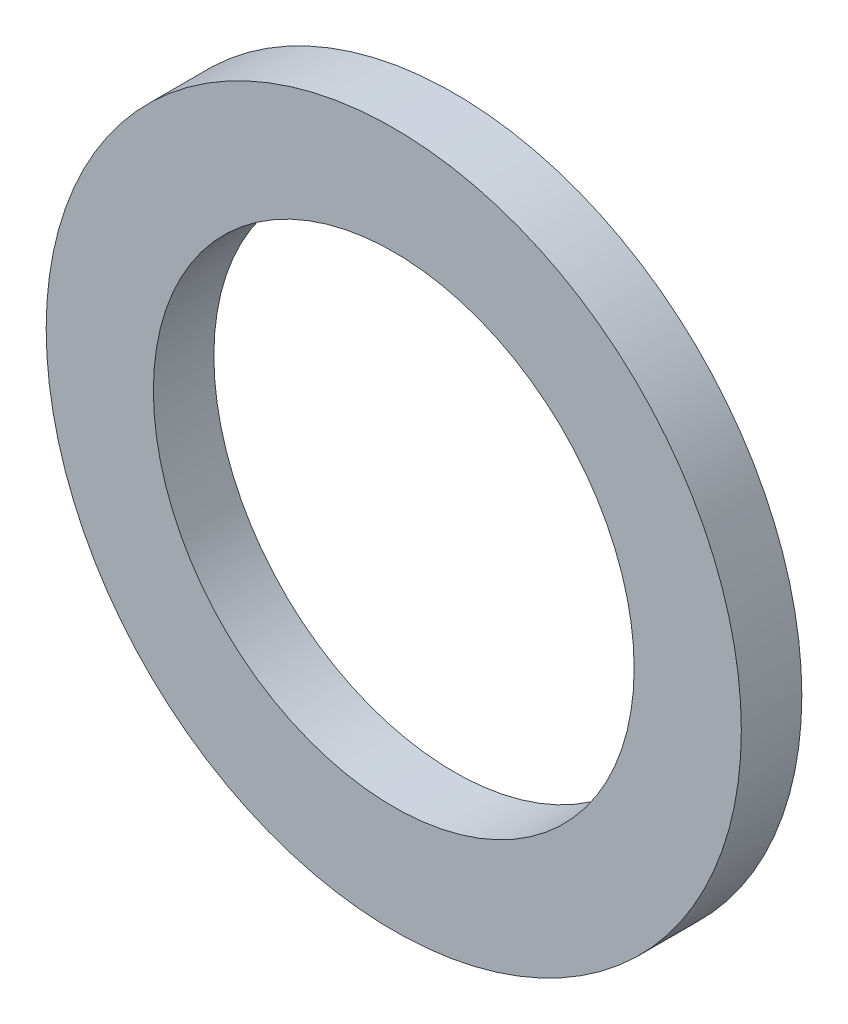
ISO-10303-21;
HEADER;
FILE_DESCRIPTION(('STEP AP214'),'2;1');
FILE_NAME('part.step','',(''),(''),'','','');
FILE_SCHEMA(('AUTOMOTIVE_DESIGN { 1 0 10303 214 1 1 1 1 }'));
ENDSEC;
DATA;
#1=APPLICATION_CONTEXT('core data for automotive mechanical design processes');
#2=APPLICATION_PROTOCOL_DEFINITION('international standard','automotive_design',2000,#1);
#3=PRODUCT_CONTEXT('',#1,'mechanical');
#4=PRODUCT('Part','Part','',(#3));
#5=PRODUCT_RELATED_PRODUCT_CATEGORY('part','',(#4));
#6=PRODUCT_DEFINITION_FORMATION('','',#4);
#7=PRODUCT_DEFINITION_CONTEXT('part definition',#1,'design');
#8=PRODUCT_DEFINITION('design','',#6,#7);
#9=PRODUCT_DEFINITION_SHAPE('','',#8);
#10=(LENGTH_UNIT() NAMED_UNIT(*) SI_UNIT(.MILLI.,.METRE.));
#11=(NAMED_UNIT(*) PLANE_ANGLE_UNIT() SI_UNIT($,.RADIAN.));
#12=(NAMED_UNIT(*) SI_UNIT($,.STERADIAN.) SOLID_ANGLE_UNIT());
#13=UNCERTAINTY_MEASURE_WITH_UNIT(LENGTH_MEASURE(1.E-05),#10,'distance_accuracy_value','');
#14=(GEOMETRIC_REPRESENTATION_CONTEXT(3) GLOBAL_UNCERTAINTY_ASSIGNED_CONTEXT((#13)) GLOBAL_UNIT_ASSIGNED_CONTEXT((#10,
#11,#12)) REPRESENTATION_CONTEXT('',''));
#15=CARTESIAN_POINT('',(0.,0.,0.));
#16=DIRECTION('',(0.,0.,1.));
#17=DIRECTION('',(1.,0.,0.));
#18=AXIS2_PLACEMENT_3D('',#15,#16,#17);
#19=CARTESIAN_POINT('',(0.,0.,0.79));
#20=DIRECTION('',(0.,0.,1.));
#21=DIRECTION('',(1.,0.,0.));
#22=AXIS2_PLACEMENT_3D('',#19,#20,#21);
#23=PLANE('',#22);
#24=CARTESIAN_POINT('',(0.,0.,0.79));
#25=DIRECTION('',(0.,0.,1.));
#26=DIRECTION('',(1.,0.,0.));
#27=AXIS2_PLACEMENT_3D('',#24,#25,#26);
#28=CIRCLE('',#27,4.54);
#29=CARTESIAN_POINT('',(-4.54,0.,0.79));
#30=VERTEX_POINT('',#29);
#31=EDGE_CURVE('E10',#30,#30,#28,.T.);
#32=ORIENTED_EDGE('',*,*,#31,.T.);
#33=EDGE_LOOP('',(#32));
#34=FACE_BOUND('',#33,.T.);
#35=CARTESIAN_POINT('',(0.,0.,0.79));
#36=DIRECTION('',(0.,0.,1.));
#37=DIRECTION('',(1.,0.,0.));
#38=AXIS2_PLACEMENT_3D('',#35,#36,#37);
#39=CIRCLE('',#38,3.14);
#40=CARTESIAN_POINT('',(-3.14,0.,0.79));
#41=VERTEX_POINT('',#40);
#42=EDGE_CURVE('E41',#41,#41,#39,.T.);
#43=ORIENTED_EDGE('',*,*,#42,.F.);
#44=EDGE_LOOP('',(#43));
#45=FACE_BOUND('',#44,.T.);
#46=ADVANCED_FACE('F30',(#34,#45),#23,.T.);
#47=CARTESIAN_POINT('',(0.,0.,0.));
#48=DIRECTION('',(0.,0.,1.));
#49=DIRECTION('',(1.,0.,0.));
#50=AXIS2_PLACEMENT_3D('',#47,#48,#49);
#51=PLANE('',#50);
#52=CARTESIAN_POINT('',(0.,0.,0.));
#53=DIRECTION('',(0.,0.,1.));
#54=DIRECTION('',(1.,0.,0.));
#55=AXIS2_PLACEMENT_3D('',#52,#53,#54);
#56=CIRCLE('',#55,4.54);
#57=CARTESIAN_POINT('',(-4.54,0.,0.));
#58=VERTEX_POINT('',#57);
#59=EDGE_CURVE('E34',#58,#58,#56,.T.);
#60=ORIENTED_EDGE('',*,*,#59,.F.);
#61=EDGE_LOOP('',(#60));
#62=FACE_BOUND('',#61,.T.);
#63=CARTESIAN_POINT('',(0.,0.,0.));
#64=DIRECTION('',(0.,0.,1.));
#65=DIRECTION('',(1.,0.,0.));
#66=AXIS2_PLACEMENT_3D('',#63,#64,#65);
#67=CIRCLE('',#66,3.14);
#68=CARTESIAN_POINT('',(-3.14,0.,0.));
#69=VERTEX_POINT('',#68);
#70=EDGE_CURVE('E43',#69,#69,#67,.T.);
#71=ORIENTED_EDGE('',*,*,#70,.T.);
#72=EDGE_LOOP('',(#71));
#73=FACE_BOUND('',#72,.T.);
#74=ADVANCED_FACE('F53',(#62,#73),#51,.F.);
#75=CARTESIAN_POINT('',(0.,0.,0.79));
#76=DIRECTION('',(0.,0.,-1.));
#77=DIRECTION('',(-1.,0.,0.));
#78=AXIS2_PLACEMENT_3D('',#75,#76,#77);
#79=CYLINDRICAL_SURFACE('',#78,4.54);
#80=CARTESIAN_POINT('',(-4.54,0.,0.79));
#81=CARTESIAN_POINT('',(-4.54,0.,0.781770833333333));
#82=CARTESIAN_POINT('',(-4.54,0.,0.773541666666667));
#83=CARTESIAN_POINT('',(-4.54,0.,0.757083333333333));
#84=CARTESIAN_POINT('',(-4.54,0.,0.748854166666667));
#85=CARTESIAN_POINT('',(-4.54,0.,0.732395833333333));
#86=CARTESIAN_POINT('',(-4.54,0.,0.724166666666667));
#87=CARTESIAN_POINT('',(-4.54,0.,0.707708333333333));
#88=CARTESIAN_POINT('',(-4.54,0.,0.699479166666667));
#89=CARTESIAN_POINT('',(-4.54,0.,0.683020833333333));
#90=CARTESIAN_POINT('',(-4.54,0.,0.674791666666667));
#91=CARTESIAN_POINT('',(-4.54,0.,0.658333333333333));
#92=CARTESIAN_POINT('',(-4.54,0.,0.650104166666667));
#93=CARTESIAN_POINT('',(-4.54,0.,0.633645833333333));
#94=CARTESIAN_POINT('',(-4.54,0.,0.625416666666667));
#95=CARTESIAN_POINT('',(-4.54,0.,0.608958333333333));
#96=CARTESIAN_POINT('',(-4.54,0.,0.600729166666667));
#97=CARTESIAN_POINT('',(-4.54,0.,0.584270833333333));
#98=CARTESIAN_POINT('',(-4.54,0.,0.576041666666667));
#99=CARTESIAN_POINT('',(-4.54,0.,0.559583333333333));
#100=CARTESIAN_POINT('',(-4.54,0.,0.551354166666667));
#101=CARTESIAN_POINT('',(-4.54,0.,0.534895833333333));
#102=CARTESIAN_POINT('',(-4.54,0.,0.526666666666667));
#103=CARTESIAN_POINT('',(-4.54,0.,0.510208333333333));
#104=CARTESIAN_POINT('',(-4.54,0.,0.501979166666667));
#105=CARTESIAN_POINT('',(-4.54,0.,0.485520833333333));
#106=CARTESIAN_POINT('',(-4.54,0.,0.477291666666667));
#107=CARTESIAN_POINT('',(-4.54,0.,0.460833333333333));
#108=CARTESIAN_POINT('',(-4.54,0.,0.452604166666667));
#109=CARTESIAN_POINT('',(-4.54,0.,0.436145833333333));
#110=CARTESIAN_POINT('',(-4.54,0.,0.427916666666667));
#111=CARTESIAN_POINT('',(-4.54,0.,0.411458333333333));
#112=CARTESIAN_POINT('',(-4.54,0.,0.403229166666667));
#113=CARTESIAN_POINT('',(-4.54,0.,0.386770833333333));
#114=CARTESIAN_POINT('',(-4.54,0.,0.378541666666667));
#115=CARTESIAN_POINT('',(-4.54,0.,0.362083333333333));
#116=CARTESIAN_POINT('',(-4.54,0.,0.353854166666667));
#117=CARTESIAN_POINT('',(-4.54,0.,0.337395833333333));
#118=CARTESIAN_POINT('',(-4.54,0.,0.329166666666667));
#119=CARTESIAN_POINT('',(-4.54,0.,0.312708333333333));
#120=CARTESIAN_POINT('',(-4.54,0.,0.304479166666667));
#121=CARTESIAN_POINT('',(-4.54,0.,0.288020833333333));
#122=CARTESIAN_POINT('',(-4.54,0.,0.279791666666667));
#123=CARTESIAN_POINT('',(-4.54,0.,0.263333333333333));
#124=CARTESIAN_POINT('',(-4.54,0.,0.255104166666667));
#125=CARTESIAN_POINT('',(-4.54,0.,0.238645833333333));
#126=CARTESIAN_POINT('',(-4.54,0.,0.230416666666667));
#127=CARTESIAN_POINT('',(-4.54,0.,0.213958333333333));
#128=CARTESIAN_POINT('',(-4.54,0.,0.205729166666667));
#129=CARTESIAN_POINT('',(-4.54,0.,0.189270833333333));
#130=CARTESIAN_POINT('',(-4.54,0.,0.181041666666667));
#131=CARTESIAN_POINT('',(-4.54,0.,0.164583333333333));
#132=CARTESIAN_POINT('',(-4.54,0.,0.156354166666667));
#133=CARTESIAN_POINT('',(-4.54,0.,0.139895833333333));
#134=CARTESIAN_POINT('',(-4.54,0.,0.131666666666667));
#135=CARTESIAN_POINT('',(-4.54,0.,0.115208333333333));
#136=CARTESIAN_POINT('',(-4.54,0.,0.106979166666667));
#137=CARTESIAN_POINT('',(-4.54,0.,0.0905208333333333));
#138=CARTESIAN_POINT('',(-4.54,0.,0.0822916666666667));
#139=CARTESIAN_POINT('',(-4.54,0.,0.0658333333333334));
#140=CARTESIAN_POINT('',(-4.54,0.,0.0576041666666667));
#141=CARTESIAN_POINT('',(-4.54,0.,0.0411458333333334));
#142=CARTESIAN_POINT('',(-4.54,0.,0.0329166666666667));
#143=CARTESIAN_POINT('',(-4.54,0.,0.0164583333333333));
#144=CARTESIAN_POINT('',(-4.54,0.,0.00822916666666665));
#145=CARTESIAN_POINT('',(-4.54,0.,0.));
#146=B_SPLINE_CURVE_WITH_KNOTS('',3,(#80,#81,#82,#83,#84,#85,#86,#87,#88,#89,#90,#91,#92,#93,
#94,#95,#96,#97,#98,#99,#100,#101,#102,#103,#104,#105,#106,#107,#108,#109,#110,#111,#112,#113,
#114,#115,#116,#117,#118,#119,#120,#121,#122,#123,#124,#125,#126,#127,#128,#129,#130,#131,#132,
#133,#134,#135,#136,#137,#138,#139,#140,#141,#142,#143,#144,#145),.UNSPECIFIED.,.F.,.F.,(4,2,2,
2,2,2,2,2,2,2,2,2,2,2,2,2,2,2,2,2,2,2,2,2,2,2,2,2,2,2,2,2,4),(0.,0.0246875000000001,
0.0493750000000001,0.0740625,0.0987500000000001,0.1234375,0.148125,0.1728125,0.1975,0.2221875,
0.246875,0.2715625,0.29625,0.3209375,0.345625,0.3703125,0.395,0.4196875,0.444375,0.4690625,
0.49375,0.5184375,0.543125,0.5678125,0.5925,0.6171875,0.641875,0.6665625,0.69125,0.7159375,
0.740625,0.7653125,0.79),.UNSPECIFIED.);
#147=EDGE_CURVE('BSEAM32',#30,#58,#146,.T.);
#148=ORIENTED_EDGE('',*,*,#31,.F.);
#149=ORIENTED_EDGE('',*,*,#59,.T.);
#150=ORIENTED_EDGE('',*,*,#147,.T.);
#151=ORIENTED_EDGE('',*,*,#147,.F.);
#152=EDGE_LOOP('',(#148,#150,#149,#151));
#153=FACE_BOUND('',#152,.T.);
#154=ADVANCED_FACE('F32',(#153),#79,.T.);
#155=CARTESIAN_POINT('',(0.,0.,0.79));
#156=DIRECTION('',(0.,0.,-1.));
#157=DIRECTION('',(-1.,0.,0.));
#158=AXIS2_PLACEMENT_3D('',#155,#156,#157);
#159=CYLINDRICAL_SURFACE('',#158,3.14);
#160=CARTESIAN_POINT('',(-3.14,0.,0.79));
#161=CARTESIAN_POINT('',(-3.14,0.,0.781770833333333));
#162=CARTESIAN_POINT('',(-3.14,0.,0.773541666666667));
#163=CARTESIAN_POINT('',(-3.14,0.,0.757083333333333));
#164=CARTESIAN_POINT('',(-3.14,0.,0.748854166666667));
#165=CARTESIAN_POINT('',(-3.14,0.,0.732395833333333));
#166=CARTESIAN_POINT('',(-3.14,0.,0.724166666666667));
#167=CARTESIAN_POINT('',(-3.14,0.,0.707708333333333));
#168=CARTESIAN_POINT('',(-3.14,0.,0.699479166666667));
#169=CARTESIAN_POINT('',(-3.14,0.,0.683020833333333));
#170=CARTESIAN_POINT('',(-3.14,0.,0.674791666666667));
#171=CARTESIAN_POINT('',(-3.14,0.,0.658333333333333));
#172=CARTESIAN_POINT('',(-3.14,0.,0.650104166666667));
#173=CARTESIAN_POINT('',(-3.14,0.,0.633645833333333));
#174=CARTESIAN_POINT('',(-3.14,0.,0.625416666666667));
#175=CARTESIAN_POINT('',(-3.14,0.,0.608958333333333));
#176=CARTESIAN_POINT('',(-3.14,0.,0.600729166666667));
#177=CARTESIAN_POINT('',(-3.14,0.,0.584270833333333));
#178=CARTESIAN_POINT('',(-3.14,0.,0.576041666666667));
#179=CARTESIAN_POINT('',(-3.14,0.,0.559583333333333));
#180=CARTESIAN_POINT('',(-3.14,0.,0.551354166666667));
#181=CARTESIAN_POINT('',(-3.14,0.,0.534895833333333));
#182=CARTESIAN_POINT('',(-3.14,0.,0.526666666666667));
#183=CARTESIAN_POINT('',(-3.14,0.,0.510208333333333));
#184=CARTESIAN_POINT('',(-3.14,0.,0.501979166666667));
#185=CARTESIAN_POINT('',(-3.14,0.,0.485520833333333));
#186=CARTESIAN_POINT('',(-3.14,0.,0.477291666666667));
#187=CARTESIAN_POINT('',(-3.14,0.,0.460833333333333));
#188=CARTESIAN_POINT('',(-3.14,0.,0.452604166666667));
#189=CARTESIAN_POINT('',(-3.14,0.,0.436145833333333));
#190=CARTESIAN_POINT('',(-3.14,0.,0.427916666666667));
#191=CARTESIAN_POINT('',(-3.14,0.,0.411458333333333));
#192=CARTESIAN_POINT('',(-3.14,0.,0.403229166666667));
#193=CARTESIAN_POINT('',(-3.14,0.,0.386770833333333));
#194=CARTESIAN_POINT('',(-3.14,0.,0.378541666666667));
#195=CARTESIAN_POINT('',(-3.14,0.,0.362083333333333));
#196=CARTESIAN_POINT('',(-3.14,0.,0.353854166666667));
#197=CARTESIAN_POINT('',(-3.14,0.,0.337395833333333));
#198=CARTESIAN_POINT('',(-3.14,0.,0.329166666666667));
#199=CARTESIAN_POINT('',(-3.14,0.,0.312708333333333));
#200=CARTESIAN_POINT('',(-3.14,0.,0.304479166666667));
#201=CARTESIAN_POINT('',(-3.14,0.,0.288020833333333));
#202=CARTESIAN_POINT('',(-3.14,0.,0.279791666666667));
#203=CARTESIAN_POINT('',(-3.14,0.,0.263333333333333));
#204=CARTESIAN_POINT('',(-3.14,0.,0.255104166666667));
#205=CARTESIAN_POINT('',(-3.14,0.,0.238645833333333));
#206=CARTESIAN_POINT('',(-3.14,0.,0.230416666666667));
#207=CARTESIAN_POINT('',(-3.14,0.,0.213958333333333));
#208=CARTESIAN_POINT('',(-3.14,0.,0.205729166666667));
#209=CARTESIAN_POINT('',(-3.14,0.,0.189270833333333));
#210=CARTESIAN_POINT('',(-3.14,0.,0.181041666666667));
#211=CARTESIAN_POINT('',(-3.14,0.,0.164583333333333));
#212=CARTESIAN_POINT('',(-3.14,0.,0.156354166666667));
#213=CARTESIAN_POINT('',(-3.14,0.,0.139895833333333));
#214=CARTESIAN_POINT('',(-3.14,0.,0.131666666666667));
#215=CARTESIAN_POINT('',(-3.14,0.,0.115208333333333));
#216=CARTESIAN_POINT('',(-3.14,0.,0.106979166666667));
#217=CARTESIAN_POINT('',(-3.14,0.,0.0905208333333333));
#218=CARTESIAN_POINT('',(-3.14,0.,0.0822916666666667));
#219=CARTESIAN_POINT('',(-3.14,0.,0.0658333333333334));
#220=CARTESIAN_POINT('',(-3.14,0.,0.0576041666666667));
#221=CARTESIAN_POINT('',(-3.14,0.,0.0411458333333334));
#222=CARTESIAN_POINT('',(-3.14,0.,0.0329166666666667));
#223=CARTESIAN_POINT('',(-3.14,0.,0.0164583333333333));
#224=CARTESIAN_POINT('',(-3.14,0.,0.00822916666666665));
#225=CARTESIAN_POINT('',(-3.14,0.,0.));
#226=B_SPLINE_CURVE_WITH_KNOTS('',3,(#160,#161,#162,#163,#164,#165,#166,#167,#168,#169,#170,
#171,#172,#173,#174,#175,#176,#177,#178,#179,#180,#181,#182,#183,#184,#185,#186,#187,#188,#189,
#190,#191,#192,#193,#194,#195,#196,#197,#198,#199,#200,#201,#202,#203,#204,#205,#206,#207,#208,
#209,#210,#211,#212,#213,#214,#215,#216,#217,#218,#219,#220,#221,#222,#223,#224,#225),
.UNSPECIFIED.,.F.,.F.,(4,2,2,2,2,2,2,2,2,2,2,2,2,2,2,2,2,2,2,2,2,2,2,2,2,2,2,2,2,2,2,2,4),(0.,
0.0246875,0.0493749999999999,0.0740624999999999,0.0987499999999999,0.1234375,0.148125,0.1728125,
0.1975,0.2221875,0.246875,0.2715625,0.29625,0.3209375,0.345625,0.3703125,0.395,0.4196875,
0.444375,0.4690625,0.49375,0.5184375,0.543125,0.5678125,0.5925,0.6171875,0.641875,0.6665625,
0.69125,0.7159375,0.740625,0.7653125,0.79),.UNSPECIFIED.);
#227=EDGE_CURVE('BSEAM49',#41,#69,#226,.T.);
#228=ORIENTED_EDGE('',*,*,#42,.T.);
#229=ORIENTED_EDGE('',*,*,#70,.F.);
#230=ORIENTED_EDGE('',*,*,#227,.T.);
#231=ORIENTED_EDGE('',*,*,#227,.F.);
#232=EDGE_LOOP('',(#228,#230,#229,#231));
#233=FACE_BOUND('',#232,.T.);
#234=ADVANCED_FACE('F49',(#233),#159,.F.);
#235=CLOSED_SHELL('',(#46,#74,#154,#234));
#236=MANIFOLD_SOLID_BREP('B2',#235);
#237=ADVANCED_BREP_SHAPE_REPRESENTATION('',(#18,#236),#14);
#238=SHAPE_DEFINITION_REPRESENTATION(#9,#237);
ENDSEC;
END-ISO-10303-21;
